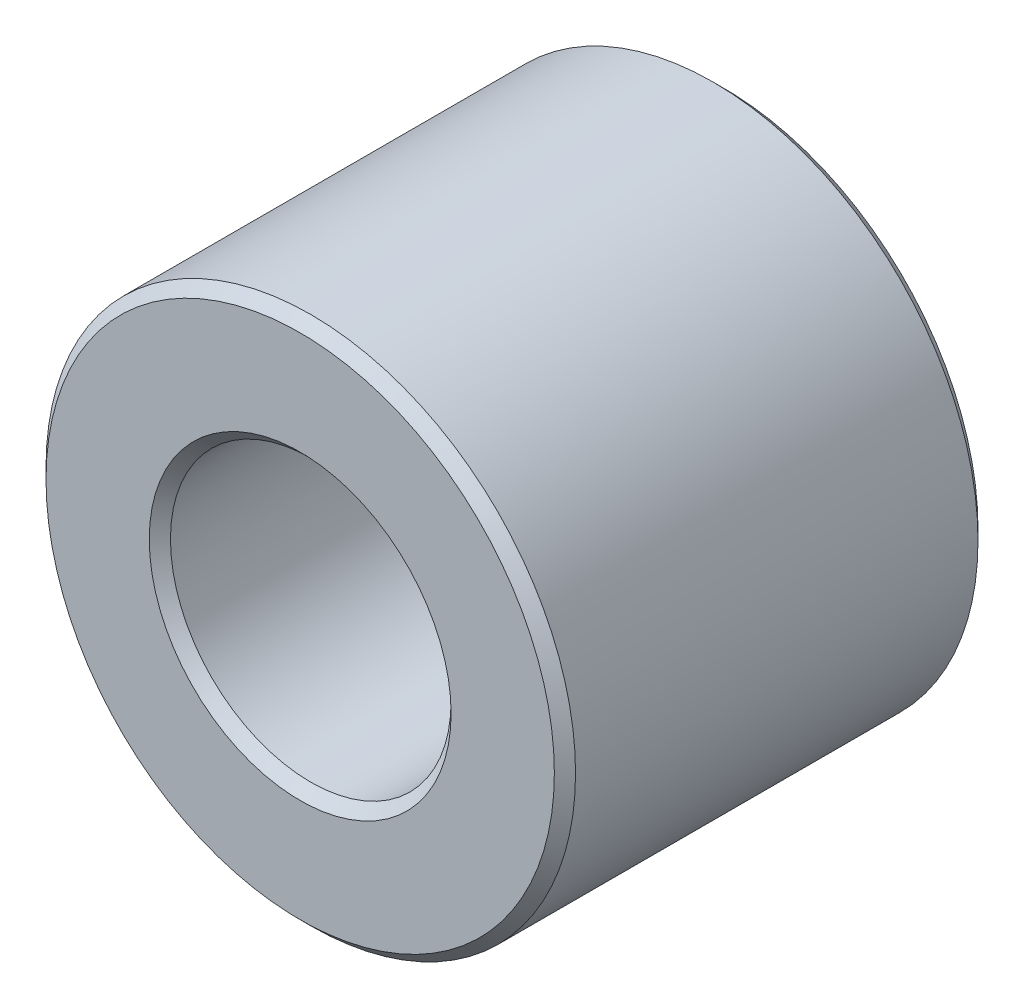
ISO-10303-21;
HEADER;
FILE_DESCRIPTION(('STEP AP214'),'2;1');
FILE_NAME('part.step','',(''),(''),'','','');
FILE_SCHEMA(('AUTOMOTIVE_DESIGN { 1 0 10303 214 1 1 1 1 }'));
ENDSEC;
DATA;
#1=APPLICATION_CONTEXT('core data for automotive mechanical design processes');
#2=APPLICATION_PROTOCOL_DEFINITION('international standard','automotive_design',2000,#1);
#3=PRODUCT_CONTEXT('',#1,'mechanical');
#4=PRODUCT('Part','Part','',(#3));
#5=PRODUCT_RELATED_PRODUCT_CATEGORY('part','',(#4));
#6=PRODUCT_DEFINITION_FORMATION('','',#4);
#7=PRODUCT_DEFINITION_CONTEXT('part definition',#1,'design');
#8=PRODUCT_DEFINITION('design','',#6,#7);
#9=PRODUCT_DEFINITION_SHAPE('','',#8);
#10=(LENGTH_UNIT() NAMED_UNIT(*) SI_UNIT(.MILLI.,.METRE.));
#11=(NAMED_UNIT(*) PLANE_ANGLE_UNIT() SI_UNIT($,.RADIAN.));
#12=(NAMED_UNIT(*) SI_UNIT($,.STERADIAN.) SOLID_ANGLE_UNIT());
#13=UNCERTAINTY_MEASURE_WITH_UNIT(LENGTH_MEASURE(1.E-05),#10,'distance_accuracy_value','');
#14=(GEOMETRIC_REPRESENTATION_CONTEXT(3) GLOBAL_UNCERTAINTY_ASSIGNED_CONTEXT((#13)) GLOBAL_UNIT_ASSIGNED_CONTEXT((#10,
#11,#12)) REPRESENTATION_CONTEXT('',''));
#15=CARTESIAN_POINT('',(0.,0.,0.));
#16=DIRECTION('',(0.,0.,1.));
#17=DIRECTION('',(1.,0.,0.));
#18=AXIS2_PLACEMENT_3D('',#15,#16,#17);
#19=CARTESIAN_POINT('',(0.,0.,4.));
#20=DIRECTION('',(0.,0.,1.));
#21=DIRECTION('',(1.,0.,0.));
#22=AXIS2_PLACEMENT_3D('',#19,#20,#21);
#23=PLANE('',#22);
#24=CARTESIAN_POINT('',(0.,0.,4.));
#25=DIRECTION('',(0.,0.,1.));
#26=DIRECTION('',(1.,0.,0.));
#27=AXIS2_PLACEMENT_3D('',#24,#25,#26);
#28=CIRCLE('',#27,2.85);
#29=CARTESIAN_POINT('',(2.85,0.,4.));
#30=VERTEX_POINT('',#29);
#31=EDGE_CURVE('E10',#30,#30,#28,.F.);
#32=ORIENTED_EDGE('',*,*,#31,.T.);
#33=EDGE_LOOP('',(#32));
#34=FACE_BOUND('',#33,.T.);
#35=CARTESIAN_POINT('',(0.,0.,4.));
#36=DIRECTION('',(0.,0.,1.));
#37=DIRECTION('',(1.,0.,0.));
#38=AXIS2_PLACEMENT_3D('',#35,#36,#37);
#39=CIRCLE('',#38,4.8);
#40=CARTESIAN_POINT('',(4.8,0.,4.));
#41=VERTEX_POINT('',#40);
#42=EDGE_CURVE('E45',#41,#41,#39,.T.);
#43=ORIENTED_EDGE('',*,*,#42,.T.);
#44=EDGE_LOOP('',(#43));
#45=FACE_BOUND('',#44,.T.);
#46=ADVANCED_FACE('F37',(#34,#45),#23,.T.);
#47=CARTESIAN_POINT('',(0.,0.,-4.));
#48=DIRECTION('',(0.,0.,1.));
#49=DIRECTION('',(1.,0.,0.));
#50=AXIS2_PLACEMENT_3D('',#47,#48,#49);
#51=PLANE('',#50);
#52=CARTESIAN_POINT('',(0.,0.,-4.));
#53=DIRECTION('',(0.,0.,1.));
#54=DIRECTION('',(1.,0.,0.));
#55=AXIS2_PLACEMENT_3D('',#52,#53,#54);
#56=CIRCLE('',#55,4.8);
#57=CARTESIAN_POINT('',(4.8,0.,-4.));
#58=VERTEX_POINT('',#57);
#59=EDGE_CURVE('E63',#58,#58,#56,.F.);
#60=ORIENTED_EDGE('',*,*,#59,.T.);
#61=EDGE_LOOP('',(#60));
#62=FACE_BOUND('',#61,.T.);
#63=CARTESIAN_POINT('',(0.,0.,-4.));
#64=DIRECTION('',(0.,0.,1.));
#65=DIRECTION('',(1.,0.,0.));
#66=AXIS2_PLACEMENT_3D('',#63,#64,#65);
#67=CIRCLE('',#66,2.85);
#68=CARTESIAN_POINT('',(2.85,0.,-4.));
#69=VERTEX_POINT('',#68);
#70=EDGE_CURVE('E67',#69,#69,#67,.T.);
#71=ORIENTED_EDGE('',*,*,#70,.T.);
#72=EDGE_LOOP('',(#71));
#73=FACE_BOUND('',#72,.T.);
#74=ADVANCED_FACE('F89',(#62,#73),#51,.F.);
#75=CARTESIAN_POINT('',(0.,0.,4.));
#76=DIRECTION('',(0.,0.,-1.));
#77=DIRECTION('',(-1.,0.,0.));
#78=AXIS2_PLACEMENT_3D('',#75,#76,#77);
#79=CYLINDRICAL_SURFACE('',#78,5.);
#80=CARTESIAN_POINT('',(0.,0.,-3.8));
#81=DIRECTION('',(0.,0.,1.));
#82=DIRECTION('',(1.,0.,0.));
#83=AXIS2_PLACEMENT_3D('',#80,#81,#82);
#84=CIRCLE('',#83,5.);
#85=CARTESIAN_POINT('',(5.,0.,-3.8));
#86=VERTEX_POINT('',#85);
#87=EDGE_CURVE('E70',#86,#86,#84,.T.);
#88=ORIENTED_EDGE('',*,*,#87,.T.);
#89=EDGE_LOOP('',(#88));
#90=FACE_BOUND('',#89,.T.);
#91=CARTESIAN_POINT('',(0.,0.,3.8));
#92=DIRECTION('',(0.,0.,1.));
#93=DIRECTION('',(1.,0.,0.));
#94=AXIS2_PLACEMENT_3D('',#91,#92,#93);
#95=CIRCLE('',#94,5.);
#96=CARTESIAN_POINT('',(5.,0.,3.8));
#97=VERTEX_POINT('',#96);
#98=EDGE_CURVE('E74',#97,#97,#95,.F.);
#99=ORIENTED_EDGE('',*,*,#98,.T.);
#100=EDGE_LOOP('',(#99));
#101=FACE_BOUND('',#100,.T.);
#102=ADVANCED_FACE('F78',(#90,#101),#79,.T.);
#103=CARTESIAN_POINT('',(0.,0.,4.));
#104=DIRECTION('',(0.,0.,-1.));
#105=DIRECTION('',(-1.,0.,0.));
#106=AXIS2_PLACEMENT_3D('',#103,#104,#105);
#107=CYLINDRICAL_SURFACE('',#106,2.65);
#108=CARTESIAN_POINT('',(0.,0.,-3.8));
#109=DIRECTION('',(0.,0.,1.));
#110=DIRECTION('',(1.,0.,0.));
#111=AXIS2_PLACEMENT_3D('',#108,#109,#110);
#112=CIRCLE('',#111,2.65);
#113=CARTESIAN_POINT('',(2.65,0.,-3.8));
#114=VERTEX_POINT('',#113);
#115=EDGE_CURVE('E52',#114,#114,#112,.F.);
#116=ORIENTED_EDGE('',*,*,#115,.T.);
#117=EDGE_LOOP('',(#116));
#118=FACE_BOUND('',#117,.T.);
#119=CARTESIAN_POINT('',(0.,0.,3.8));
#120=DIRECTION('',(0.,0.,1.));
#121=DIRECTION('',(1.,0.,0.));
#122=AXIS2_PLACEMENT_3D('',#119,#120,#121);
#123=CIRCLE('',#122,2.65);
#124=CARTESIAN_POINT('',(2.65,0.,3.8));
#125=VERTEX_POINT('',#124);
#126=EDGE_CURVE('E57',#125,#125,#123,.T.);
#127=ORIENTED_EDGE('',*,*,#126,.T.);
#128=EDGE_LOOP('',(#127));
#129=FACE_BOUND('',#128,.T.);
#130=ADVANCED_FACE('F97',(#118,#129),#107,.F.);
#131=CARTESIAN_POINT('',(0.,0.,-3.8));
#132=DIRECTION('',(0.,0.,1.));
#133=DIRECTION('',(1.,0.,0.));
#134=AXIS2_PLACEMENT_3D('',#131,#132,#133);
#135=CONICAL_SURFACE('',#134,5.,0.78539816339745);
#136=ORIENTED_EDGE('',*,*,#59,.F.);
#137=EDGE_LOOP('',(#136));
#138=FACE_BOUND('',#137,.T.);
#139=ORIENTED_EDGE('',*,*,#87,.F.);
#140=EDGE_LOOP('',(#139));
#141=FACE_BOUND('',#140,.T.);
#142=ADVANCED_FACE('F102',(#138,#141),#135,.T.);
#143=CARTESIAN_POINT('',(0.,0.,-4.));
#144=DIRECTION('',(0.,0.,-1.));
#145=DIRECTION('',(-1.,0.,0.));
#146=AXIS2_PLACEMENT_3D('',#143,#144,#145);
#147=CONICAL_SURFACE('',#146,2.85,0.785398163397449);
#148=ORIENTED_EDGE('',*,*,#115,.F.);
#149=EDGE_LOOP('',(#148));
#150=FACE_BOUND('',#149,.T.);
#151=ORIENTED_EDGE('',*,*,#70,.F.);
#152=EDGE_LOOP('',(#151));
#153=FACE_BOUND('',#152,.T.);
#154=ADVANCED_FACE('F86',(#150,#153),#147,.F.);
#155=CARTESIAN_POINT('',(0.,0.,3.8));
#156=DIRECTION('',(0.,0.,1.));
#157=DIRECTION('',(1.,0.,0.));
#158=AXIS2_PLACEMENT_3D('',#155,#156,#157);
#159=CONICAL_SURFACE('',#158,2.65,0.785398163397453);
#160=ORIENTED_EDGE('',*,*,#31,.F.);
#161=EDGE_LOOP('',(#160));
#162=FACE_BOUND('',#161,.T.);
#163=ORIENTED_EDGE('',*,*,#126,.F.);
#164=EDGE_LOOP('',(#163));
#165=FACE_BOUND('',#164,.T.);
#166=ADVANCED_FACE('F82',(#162,#165),#159,.F.);
#167=CARTESIAN_POINT('',(0.,0.,4.));
#168=DIRECTION('',(0.,0.,-1.));
#169=DIRECTION('',(-1.,0.,0.));
#170=AXIS2_PLACEMENT_3D('',#167,#168,#169);
#171=CONICAL_SURFACE('',#170,4.8,0.785398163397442);
#172=ORIENTED_EDGE('',*,*,#98,.F.);
#173=EDGE_LOOP('',(#172));
#174=FACE_BOUND('',#173,.T.);
#175=ORIENTED_EDGE('',*,*,#42,.F.);
#176=EDGE_LOOP('',(#175));
#177=FACE_BOUND('',#176,.T.);
#178=ADVANCED_FACE('F39',(#174,#177),#171,.T.);
#179=CLOSED_SHELL('',(#46,#74,#102,#130,#142,#154,#166,#178));
#180=MANIFOLD_SOLID_BREP('B2',#179);
#181=ADVANCED_BREP_SHAPE_REPRESENTATION('',(#18,#180),#14);
#182=SHAPE_DEFINITION_REPRESENTATION(#9,#181);
ENDSEC;
END-ISO-10303-21;
